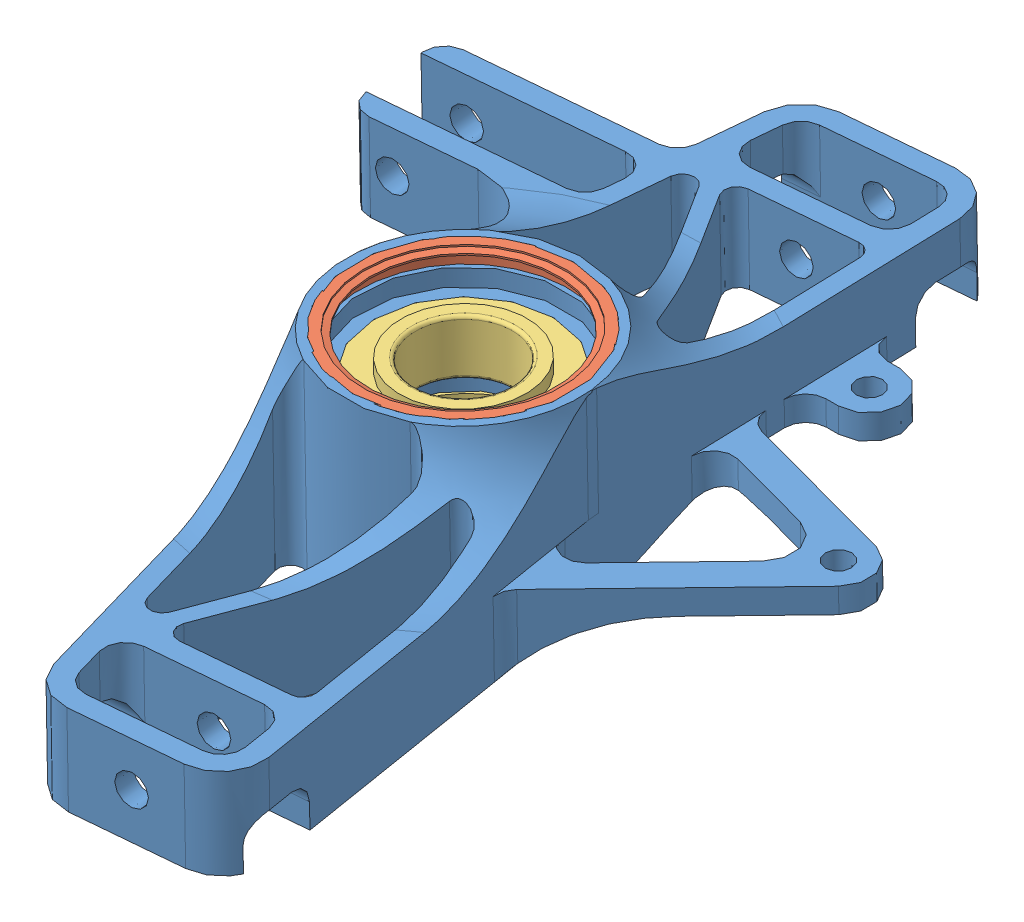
SolidWorks assembly Upright Assembly - Mirror.SLDASM, configuration Default (file format 5000). Lengths in mm.
Overall size (187.69 75.94 260.67).
5 component instances, 3 part files, 8 mates.
Components (placement in the parent):
- Upright - Mirror-1: Upright - Mirror.SLDPRT [AP Caliper] at (-28.1936 -601.3602 -253.5794) size (187.69 75.94 260.67)
- Oil Seal-1: Oil Seal.SLDPRT [Default] at (-28.1936 8.8942 0.8085) x (0 -0.999848 -0.017452) z (-0.156462 -0.017237 0.987534) size (6.35 67.59 67.59)
- Oil Seal-2: Oil Seal.SLDPRT [Default] at (-28.1936 -47.6122 -0.1778) x (0 0.999848 0.017452) z (-0.017452 -0.01745 0.999695) size (6.35 67.59 67.59)
- Tapered Roller Bearing-1: Tapered Roller Bearing.SLDPRT [Default] at (-28.1936 -26.0254 0.199) x (0 -0.999848 -0.017452) z (0.934797 -0.006199 0.355129) size (17 55 55)
- Tapered Roller Bearing-2: Tapered Roller Bearing.SLDPRT [Default] at (-28.1936 -15.7273 0.3787) x (0 0.999848 0.017452) z (0.612483 -0.013796 0.790364) size (17 55 55)
Mates (geometry in assembly coordinates):
- Concentric8: concentric aligned: circle of Upright - Mirror-1; cylinder of Oil Seal-1 through (-28.1936 66.6872 1.8173) axis (0 0.999848 0.017452) radius 33.7947
- Coincident15: coincident aligned: plane of Upright - Mirror-1 through (-155.1936 11.2758 -135.6291) normal (0 0.999848 0.017452); plane of Oil Seal-1 through (2.1744 8.8103 5.6185) normal (0 0.999848 0.017452)
- Concentric9: concentric aligned: cylinder of Upright - Mirror-1 through (-28.1936 -111.4075 -1.2914) axis (0 -0.999848 -0.017452) radius 33.782; cylinder of Oil Seal-2 through (-28.1936 -105.4052 -1.1866) axis (0 -0.999848 -0.017452) radius 33.7947
- Coincident16: coincident aligned: plane of Upright - Mirror-1 through (135.3262 -50.4622 163.1027) normal (0 -0.999848 -0.017452); plane of Oil Seal-2 through (-58.9356 -47.6028 -0.7143) normal (0 -0.999848 -0.017452)
- Concentric10: concentric anti-aligned: cylinder of Upright - Mirror-1 through (-28.1936 -111.4075 -1.2914) axis (0 -0.999848 -0.017452) radius 27.4999; cylinder of Tapered Roller Bearing-1 through (-28.1936 -26.0254 0.199) axis (0 0.999848 0.017452) radius 27.5
- Coincident17: coincident anti-aligned: plane of Upright - Mirror-1 through (-28.1936 -25.5455 -27.2968) normal (0 -0.999848 -0.017452); plane of Tapered Roller Bearing-1 through (-19.6692 -25.6339 -22.2327) normal (0 0.999848 0.017452)
- Concentric12: concentric aligned: cylinder of Upright - Mirror-1 through (-28.1936 -111.4075 -1.2914) axis (0 -0.999848 -0.017452) radius 27.4999; cylinder of Tapered Roller Bearing-2 through (-28.1936 -15.7273 0.3787) axis (0 -0.999848 -0.017452) radius 27.5
- Coincident18: coincident anti-aligned: plane of Upright - Mirror-1 through (-28.1936 -15.2917 -24.5774) normal (0 0.999848 0.017452); plane of Tapered Roller Bearing-2 through (-47.1652 -15.9839 15.0761) normal (0 -0.999848 -0.017452)
